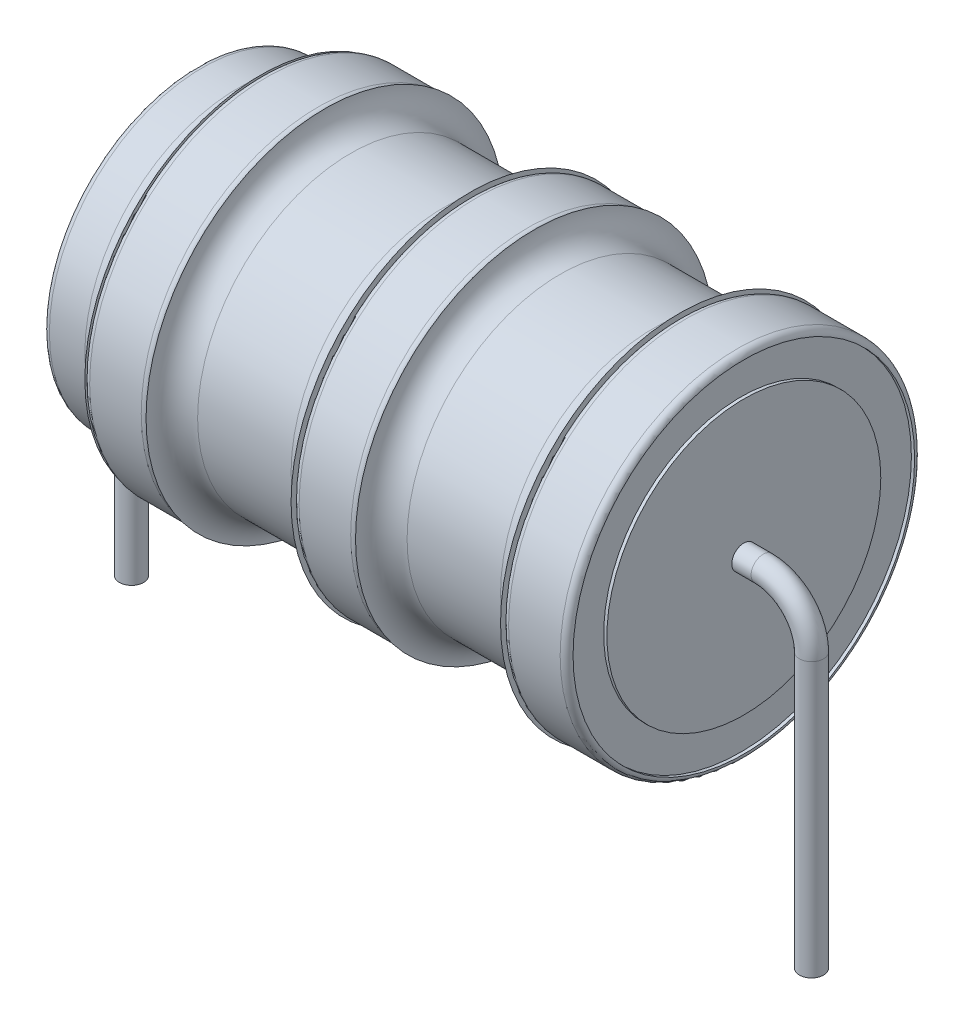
from build123d import *

# Parameters (mm, degrees)
ESQUISSE2_R             = 4.25
ENL_V_MAT_EXTRU_1_DEPTH = 0.1
ENL_V_START             = -0.1
ESQUISSE3_R             = 5.3
ESQUISSE3_R_2           = 4.25
ENL_V_MAT_EXTRU_2_DEPTH = 0.1
ESQUISSE4_R             = 0.375


with BuildPart() as part:
    # Esquisse1 → R_volution1 (revolve)
    with BuildSketch(Plane.XY, mode=Mode.PRIVATE) as r_volution1_sk:
        with BuildLine():
            Line((0, 0), (0, 4.55))
            ThreePointArc((0, 4.55), (0.058578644, 4.691421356), (0.2, 4.75))
            Line((0.2, 4.75), (1.3, 4.75))
            ThreePointArc((1.3, 4.75), (1.794974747, 4.955025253), (2, 5.45))
            Line((2, 5.45), (2, 5.3))
            ThreePointArc((2, 5.3), (2.058578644, 5.441421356), (2.2, 5.5))
            Line((2.2, 5.5), (3.8, 5.5))
            ThreePointArc((3.8, 5.5), (3.941421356, 5.441421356), (4, 5.3))
            Line((4, 5.3), (4, 5.55))
            ThreePointArc((4, 5.55), (4.234314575, 4.984314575), (4.8, 4.75))
            Line((4.8, 4.75), (7.7, 4.75))
            ThreePointArc((7.7, 4.75), (8.265685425, 4.984314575), (8.5, 5.55))
            Line((8.5, 5.55), (8.5, 5.3))
            ThreePointArc((8.5, 5.3), (8.558578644, 5.441421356), (8.7, 5.5))
            Line((8.7, 5.5), (10.3, 5.5))
            ThreePointArc((10.3, 5.5), (10.441421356, 5.441421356), (10.5, 5.3))
            Line((10.5, 5.3), (10.5, 5.55))
            ThreePointArc((10.5, 5.55), (10.734314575, 4.984314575), (11.3, 4.75))
            Line((11.3, 4.75), (14.2, 4.75))
            ThreePointArc((14.2, 4.75), (14.765685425, 4.984314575), (15, 5.55))
            Line((15, 5.55), (15, 5.3))
            ThreePointArc((15, 5.3), (15.058578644, 5.441421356), (15.2, 5.5))
            Line((15.2, 5.5), (16.8, 5.5))
            ThreePointArc((16.8, 5.5), (16.941421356, 5.441421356), (17, 5.3))
            Line((17, 5.3), (17, 0))
            Line((17, 0), (0, 0))
        make_face()
    revolve(r_volution1_sk.sketch.rotate(Axis((0, 0, 0), (1, 0, 0)), 90), axis=Axis((0, 0, 0), (1, 0, 0)))

    # Esquisse2 → Enl_v. mat.-Extru.1 (cut)
    with BuildSketch(Plane.ZY):
        Circle(ESQUISSE2_R)
    extrude(amount=-ENL_V_MAT_EXTRU_1_DEPTH, mode=Mode.SUBTRACT)

    # Esquisse3 → Enl_v. mat.-Extru.2 (cut)
    with BuildSketch(Plane(origin=(17, 0, 0), x_dir=(0, 0, -1), z_dir=(1, 0, 0)).offset(ENL_V_START)):
        Circle(ESQUISSE3_R)
        with Locations(Location((0, 0, 0), (0, 0, 180))):
            Circle(ESQUISSE3_R_2, mode=Mode.SUBTRACT)
    extrude(amount=ENL_V_MAT_EXTRU_2_DEPTH, mode=Mode.SUBTRACT)

    # Balayage4: sweep along a path in Esquisse5
    with BuildLine(Plane.XY) as balayage4_path:
        Line((-2, -10), (-2, -1.5))
        ThreePointArc((-2, -1.5), (-1.560660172, -0.439339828), (-0.5, 0))
        Line((-0.5, 0), (0, 0))
        Line((0, 0), (0.1, 0))
    # Esquisse4 → Balayage4 (sweep)
    with BuildSketch(Plane.ZY.offset(-0.1)):
        Circle(ESQUISSE4_R)
    balayage4 = sweep(path=balayage4_path.line)

    # Sym_trie1: Balayage4 across plane
    add(balayage4.mirror(Plane.ZY.offset(-8.55)))


solid = part.part
